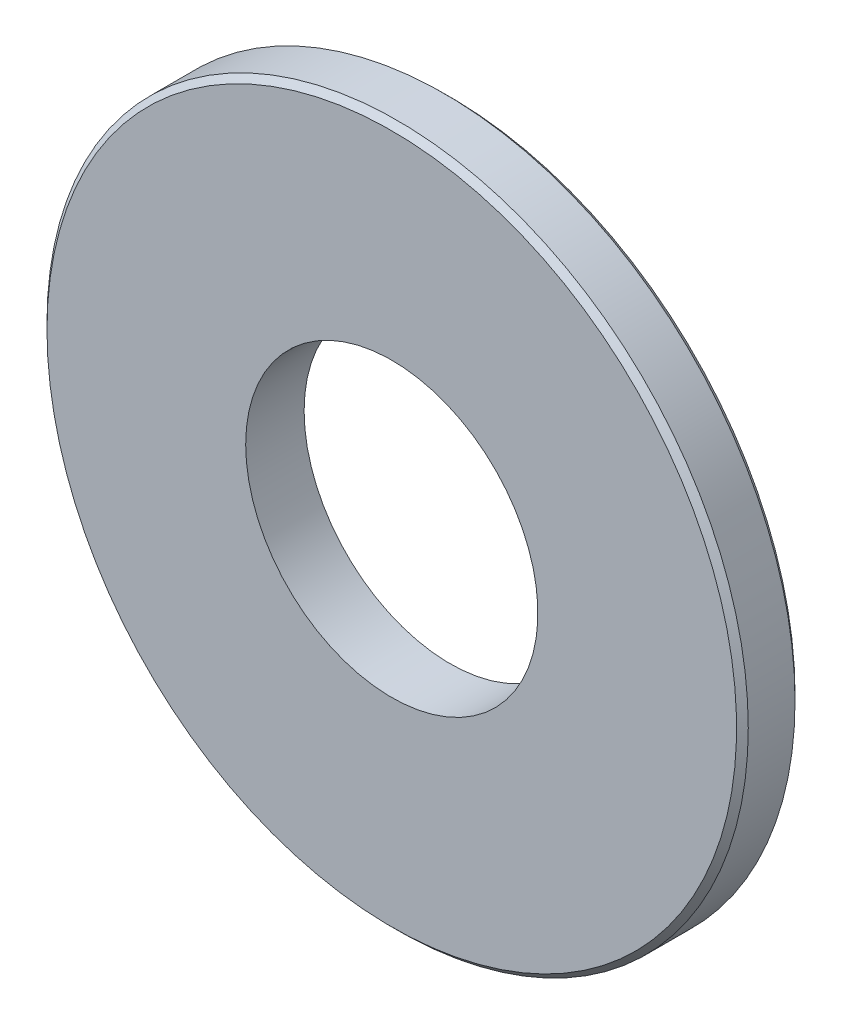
ISO-10303-21;
HEADER;
FILE_DESCRIPTION(('STEP AP214'),'2;1');
FILE_NAME('part.step','',(''),(''),'','','');
FILE_SCHEMA(('AUTOMOTIVE_DESIGN { 1 0 10303 214 1 1 1 1 }'));
ENDSEC;
DATA;
#1=APPLICATION_CONTEXT('core data for automotive mechanical design processes');
#2=APPLICATION_PROTOCOL_DEFINITION('international standard','automotive_design',2000,#1);
#3=PRODUCT_CONTEXT('',#1,'mechanical');
#4=PRODUCT('Part','Part','',(#3));
#5=PRODUCT_RELATED_PRODUCT_CATEGORY('part','',(#4));
#6=PRODUCT_DEFINITION_FORMATION('','',#4);
#7=PRODUCT_DEFINITION_CONTEXT('part definition',#1,'design');
#8=PRODUCT_DEFINITION('design','',#6,#7);
#9=PRODUCT_DEFINITION_SHAPE('','',#8);
#10=(LENGTH_UNIT() NAMED_UNIT(*) SI_UNIT(.MILLI.,.METRE.));
#11=(NAMED_UNIT(*) PLANE_ANGLE_UNIT() SI_UNIT($,.RADIAN.));
#12=(NAMED_UNIT(*) SI_UNIT($,.STERADIAN.) SOLID_ANGLE_UNIT());
#13=UNCERTAINTY_MEASURE_WITH_UNIT(LENGTH_MEASURE(1.E-05),#10,'distance_accuracy_value','');
#14=(GEOMETRIC_REPRESENTATION_CONTEXT(3) GLOBAL_UNCERTAINTY_ASSIGNED_CONTEXT((#13)) GLOBAL_UNIT_ASSIGNED_CONTEXT((#10,
#11,#12)) REPRESENTATION_CONTEXT('',''));
#15=CARTESIAN_POINT('',(0.,0.,0.));
#16=DIRECTION('',(0.,0.,1.));
#17=DIRECTION('',(1.,0.,0.));
#18=AXIS2_PLACEMENT_3D('',#15,#16,#17);
#19=CARTESIAN_POINT('',(0.,0.,1.00000000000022));
#20=DIRECTION('',(0.,0.,1.));
#21=DIRECTION('',(1.00000000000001,0.,0.));
#22=AXIS2_PLACEMENT_3D('',#19,#20,#21);
#23=PLANE('',#22);
#24=CARTESIAN_POINT('',(0.,0.,1.00000000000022));
#25=DIRECTION('',(0.,0.,1.));
#26=DIRECTION('',(1.00000000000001,0.,0.));
#27=AXIS2_PLACEMENT_3D('',#24,#25,#26);
#28=CIRCLE('',#27,5.9);
#29=CARTESIAN_POINT('',(-5.90000000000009,0.,1.00000000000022));
#30=VERTEX_POINT('',#29);
#31=EDGE_CURVE('E53',#30,#30,#28,.T.);
#32=ORIENTED_EDGE('',*,*,#31,.T.);
#33=EDGE_LOOP('',(#32));
#34=FACE_BOUND('',#33,.T.);
#35=CARTESIAN_POINT('',(0.,0.,1.00000000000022));
#36=DIRECTION('',(0.,0.,1.));
#37=DIRECTION('',(1.00000000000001,0.,0.));
#38=AXIS2_PLACEMENT_3D('',#35,#36,#37);
#39=CIRCLE('',#38,2.5);
#40=CARTESIAN_POINT('',(-2.50000000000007,0.,1.00000000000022));
#41=VERTEX_POINT('',#40);
#42=EDGE_CURVE('E58',#41,#41,#39,.T.);
#43=ORIENTED_EDGE('',*,*,#42,.F.);
#44=EDGE_LOOP('',(#43));
#45=FACE_BOUND('',#44,.T.);
#46=ADVANCED_FACE('F38',(#34,#45),#23,.T.);
#47=CARTESIAN_POINT('',(-1.11022302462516E-13,0.,3.33066907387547E-13));
#48=DIRECTION('',(0.,0.,1.));
#49=DIRECTION('',(1.00000000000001,0.,0.));
#50=AXIS2_PLACEMENT_3D('',#47,#48,#49);
#51=PLANE('',#50);
#52=CARTESIAN_POINT('',(-1.11022302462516E-13,0.,3.33066907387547E-13));
#53=DIRECTION('',(0.,0.,1.));
#54=DIRECTION('',(1.00000000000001,0.,0.));
#55=AXIS2_PLACEMENT_3D('',#52,#53,#54);
#56=CIRCLE('',#55,5.9);
#57=CARTESIAN_POINT('',(5.89999999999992,0.,3.3386175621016E-13));
#58=VERTEX_POINT('',#57);
#59=EDGE_CURVE('E10',#58,#58,#56,.F.);
#60=ORIENTED_EDGE('',*,*,#59,.T.);
#61=EDGE_LOOP('',(#60));
#62=FACE_BOUND('',#61,.T.);
#63=CARTESIAN_POINT('',(-1.11022302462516E-13,0.,3.33066907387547E-13));
#64=DIRECTION('',(0.,0.,1.));
#65=DIRECTION('',(1.00000000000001,0.,0.));
#66=AXIS2_PLACEMENT_3D('',#63,#64,#65);
#67=CIRCLE('',#66,2.5);
#68=CARTESIAN_POINT('',(-2.50000000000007,0.,3.33283747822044E-13));
#69=VERTEX_POINT('',#68);
#70=EDGE_CURVE('E61',#69,#69,#67,.T.);
#71=ORIENTED_EDGE('',*,*,#70,.T.);
#72=EDGE_LOOP('',(#71));
#73=FACE_BOUND('',#72,.T.);
#74=ADVANCED_FACE('F65',(#62,#73),#51,.F.);
#75=CARTESIAN_POINT('',(0.,0.,1.00000000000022));
#76=DIRECTION('',(0.,0.,-1.));
#77=DIRECTION('',(-1.00000000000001,0.,0.));
#78=AXIS2_PLACEMENT_3D('',#75,#76,#77);
#79=CYLINDRICAL_SURFACE('',#78,6.);
#80=CARTESIAN_POINT('',(0.,0.,0.900000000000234));
#81=DIRECTION('',(0.,0.,1.));
#82=DIRECTION('',(1.00000000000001,0.,0.));
#83=AXIS2_PLACEMENT_3D('',#80,#81,#82);
#84=CIRCLE('',#83,6.);
#85=CARTESIAN_POINT('',(-6.00000000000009,0.,0.900000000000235));
#86=VERTEX_POINT('',#85);
#87=EDGE_CURVE('E45',#86,#86,#84,.F.);
#88=CARTESIAN_POINT('',(0.,0.,0.100000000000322));
#89=DIRECTION('',(0.,0.,1.));
#90=DIRECTION('',(1.00000000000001,0.,0.));
#91=AXIS2_PLACEMENT_3D('',#88,#89,#90);
#92=CIRCLE('',#91,6.);
#93=CARTESIAN_POINT('',(-6.00000000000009,0.,0.100000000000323));
#94=VERTEX_POINT('',#93);
#95=EDGE_CURVE('E49',#94,#94,#92,.T.);
#96=CARTESIAN_POINT('',(-6.00000000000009,0.,0.900000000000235));
#97=CARTESIAN_POINT('',(-6.00000000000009,0.,0.891666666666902));
#98=CARTESIAN_POINT('',(-6.00000000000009,0.,0.88333333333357));
#99=CARTESIAN_POINT('',(-6.00000000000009,0.,0.866666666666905));
#100=CARTESIAN_POINT('',(-6.00000000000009,0.,0.858333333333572));
#101=CARTESIAN_POINT('',(-6.00000000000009,0.,0.841666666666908));
#102=CARTESIAN_POINT('',(-6.00000000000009,0.,0.833333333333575));
#103=CARTESIAN_POINT('',(-6.00000000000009,0.,0.81666666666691));
#104=CARTESIAN_POINT('',(-6.00000000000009,0.,0.808333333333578));
#105=CARTESIAN_POINT('',(-6.00000000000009,0.,0.791666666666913));
#106=CARTESIAN_POINT('',(-6.00000000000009,0.,0.783333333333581));
#107=CARTESIAN_POINT('',(-6.00000000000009,0.,0.766666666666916));
#108=CARTESIAN_POINT('',(-6.00000000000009,0.,0.758333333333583));
#109=CARTESIAN_POINT('',(-6.00000000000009,0.,0.741666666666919));
#110=CARTESIAN_POINT('',(-6.00000000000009,0.,0.733333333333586));
#111=CARTESIAN_POINT('',(-6.00000000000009,0.,0.716666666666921));
#112=CARTESIAN_POINT('',(-6.00000000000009,0.,0.708333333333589));
#113=CARTESIAN_POINT('',(-6.00000000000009,0.,0.691666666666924));
#114=CARTESIAN_POINT('',(-6.00000000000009,0.,0.683333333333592));
#115=CARTESIAN_POINT('',(-6.00000000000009,0.,0.666666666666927));
#116=CARTESIAN_POINT('',(-6.00000000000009,0.,0.658333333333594));
#117=CARTESIAN_POINT('',(-6.00000000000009,0.,0.64166666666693));
#118=CARTESIAN_POINT('',(-6.00000000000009,0.,0.633333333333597));
#119=CARTESIAN_POINT('',(-6.00000000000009,0.,0.616666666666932));
#120=CARTESIAN_POINT('',(-6.00000000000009,0.,0.6083333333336));
#121=CARTESIAN_POINT('',(-6.00000000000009,0.,0.591666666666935));
#122=CARTESIAN_POINT('',(-6.00000000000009,0.,0.583333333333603));
#123=CARTESIAN_POINT('',(-6.00000000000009,0.,0.566666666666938));
#124=CARTESIAN_POINT('',(-6.00000000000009,0.,0.558333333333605));
#125=CARTESIAN_POINT('',(-6.00000000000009,0.,0.541666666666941));
#126=CARTESIAN_POINT('',(-6.00000000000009,0.,0.533333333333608));
#127=CARTESIAN_POINT('',(-6.00000000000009,0.,0.516666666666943));
#128=CARTESIAN_POINT('',(-6.00000000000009,0.,0.508333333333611));
#129=CARTESIAN_POINT('',(-6.00000000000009,0.,0.491666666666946));
#130=CARTESIAN_POINT('',(-6.00000000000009,0.,0.483333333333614));
#131=CARTESIAN_POINT('',(-6.00000000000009,0.,0.466666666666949));
#132=CARTESIAN_POINT('',(-6.00000000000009,0.,0.458333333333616));
#133=CARTESIAN_POINT('',(-6.00000000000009,0.,0.441666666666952));
#134=CARTESIAN_POINT('',(-6.00000000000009,0.,0.433333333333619));
#135=CARTESIAN_POINT('',(-6.00000000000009,0.,0.416666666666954));
#136=CARTESIAN_POINT('',(-6.00000000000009,0.,0.408333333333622));
#137=CARTESIAN_POINT('',(-6.00000000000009,0.,0.391666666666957));
#138=CARTESIAN_POINT('',(-6.00000000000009,0.,0.383333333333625));
#139=CARTESIAN_POINT('',(-6.00000000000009,0.,0.36666666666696));
#140=CARTESIAN_POINT('',(-6.00000000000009,0.,0.358333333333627));
#141=CARTESIAN_POINT('',(-6.00000000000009,0.,0.341666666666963));
#142=CARTESIAN_POINT('',(-6.00000000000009,0.,0.33333333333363));
#143=CARTESIAN_POINT('',(-6.00000000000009,0.,0.316666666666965));
#144=CARTESIAN_POINT('',(-6.00000000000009,0.,0.308333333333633));
#145=CARTESIAN_POINT('',(-6.00000000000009,0.,0.291666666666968));
#146=CARTESIAN_POINT('',(-6.00000000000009,0.,0.283333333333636));
#147=CARTESIAN_POINT('',(-6.00000000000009,0.,0.266666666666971));
#148=CARTESIAN_POINT('',(-6.00000000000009,0.,0.258333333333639));
#149=CARTESIAN_POINT('',(-6.00000000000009,0.,0.241666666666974));
#150=CARTESIAN_POINT('',(-6.00000000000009,0.,0.233333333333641));
#151=CARTESIAN_POINT('',(-6.00000000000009,0.,0.216666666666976));
#152=CARTESIAN_POINT('',(-6.00000000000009,0.,0.208333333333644));
#153=CARTESIAN_POINT('',(-6.00000000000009,0.,0.191666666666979));
#154=CARTESIAN_POINT('',(-6.00000000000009,0.,0.183333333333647));
#155=CARTESIAN_POINT('',(-6.00000000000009,0.,0.166666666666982));
#156=CARTESIAN_POINT('',(-6.00000000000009,0.,0.15833333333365));
#157=CARTESIAN_POINT('',(-6.00000000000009,0.,0.141666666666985));
#158=CARTESIAN_POINT('',(-6.00000000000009,0.,0.133333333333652));
#159=CARTESIAN_POINT('',(-6.00000000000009,0.,0.116666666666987));
#160=CARTESIAN_POINT('',(-6.00000000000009,0.,0.108333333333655));
#161=CARTESIAN_POINT('',(-6.00000000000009,0.,0.100000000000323));
#162=B_SPLINE_CURVE_WITH_KNOTS('',3,(#96,#97,#98,#99,#100,#101,#102,#103,#104,#105,#106,#107,
#108,#109,#110,#111,#112,#113,#114,#115,#116,#117,#118,#119,#120,#121,#122,#123,#124,#125,#126,
#127,#128,#129,#130,#131,#132,#133,#134,#135,#136,#137,#138,#139,#140,#141,#142,#143,#144,#145,
#146,#147,#148,#149,#150,#151,#152,#153,#154,#155,#156,#157,#158,#159,#160,#161),.UNSPECIFIED.,
.F.,.F.,(4,2,2,2,2,2,2,2,2,2,2,2,2,2,2,2,2,2,2,2,2,2,2,2,2,2,2,2,2,2,2,2,4),(0.,
0.0249999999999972,0.0499999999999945,0.0749999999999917,0.099999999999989,0.124999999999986,
0.149999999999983,0.174999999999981,0.199999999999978,0.224999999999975,0.249999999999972,
0.27499999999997,0.299999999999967,0.324999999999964,0.349999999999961,0.374999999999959,
0.399999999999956,0.424999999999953,0.44999999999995,0.474999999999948,0.499999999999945,
0.524999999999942,0.549999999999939,0.574999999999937,0.599999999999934,0.624999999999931,
0.649999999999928,0.674999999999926,0.699999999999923,0.72499999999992,0.749999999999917,
0.774999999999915,0.799999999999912),.UNSPECIFIED.);
#163=EDGE_CURVE('BSEAM40',#86,#94,#162,.T.);
#164=ORIENTED_EDGE('',*,*,#87,.T.);
#165=ORIENTED_EDGE('',*,*,#95,.T.);
#166=ORIENTED_EDGE('',*,*,#163,.T.);
#167=ORIENTED_EDGE('',*,*,#163,.F.);
#168=EDGE_LOOP('',(#164,#166,#165,#167));
#169=FACE_BOUND('',#168,.T.);
#170=ADVANCED_FACE('F40',(#169),#79,.T.);
#171=CARTESIAN_POINT('',(0.,0.,1.00000000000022));
#172=DIRECTION('',(0.,0.,-1.));
#173=DIRECTION('',(-1.00000000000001,0.,0.));
#174=AXIS2_PLACEMENT_3D('',#171,#172,#173);
#175=CYLINDRICAL_SURFACE('',#174,2.5);
#176=CARTESIAN_POINT('',(-2.50000000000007,0.,1.00000000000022));
#177=CARTESIAN_POINT('',(-2.50000000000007,0.,0.989583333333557));
#178=CARTESIAN_POINT('',(-2.50000000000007,0.,0.979166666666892));
#179=CARTESIAN_POINT('',(-2.50000000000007,0.,0.958333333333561));
#180=CARTESIAN_POINT('',(-2.50000000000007,0.,0.947916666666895));
#181=CARTESIAN_POINT('',(-2.50000000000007,0.,0.927083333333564));
#182=CARTESIAN_POINT('',(-2.50000000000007,0.,0.916666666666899));
#183=CARTESIAN_POINT('',(-2.50000000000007,0.,0.895833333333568));
#184=CARTESIAN_POINT('',(-2.50000000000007,0.,0.885416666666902));
#185=CARTESIAN_POINT('',(-2.50000000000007,0.,0.864583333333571));
#186=CARTESIAN_POINT('',(-2.50000000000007,0.,0.854166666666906));
#187=CARTESIAN_POINT('',(-2.50000000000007,0.,0.833333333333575));
#188=CARTESIAN_POINT('',(-2.50000000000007,0.,0.822916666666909));
#189=CARTESIAN_POINT('',(-2.50000000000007,0.,0.802083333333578));
#190=CARTESIAN_POINT('',(-2.50000000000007,0.,0.791666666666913));
#191=CARTESIAN_POINT('',(-2.50000000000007,0.,0.770833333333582));
#192=CARTESIAN_POINT('',(-2.50000000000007,0.,0.760416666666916));
#193=CARTESIAN_POINT('',(-2.50000000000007,0.,0.739583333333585));
#194=CARTESIAN_POINT('',(-2.50000000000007,0.,0.72916666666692));
#195=CARTESIAN_POINT('',(-2.50000000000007,0.,0.708333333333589));
#196=CARTESIAN_POINT('',(-2.50000000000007,0.,0.697916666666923));
#197=CARTESIAN_POINT('',(-2.50000000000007,0.,0.677083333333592));
#198=CARTESIAN_POINT('',(-2.50000000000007,0.,0.666666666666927));
#199=CARTESIAN_POINT('',(-2.50000000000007,0.,0.645833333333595));
#200=CARTESIAN_POINT('',(-2.50000000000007,0.,0.63541666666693));
#201=CARTESIAN_POINT('',(-2.50000000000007,0.,0.614583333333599));
#202=CARTESIAN_POINT('',(-2.50000000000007,0.,0.604166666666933));
#203=CARTESIAN_POINT('',(-2.50000000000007,0.,0.583333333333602));
#204=CARTESIAN_POINT('',(-2.50000000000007,0.,0.572916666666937));
#205=CARTESIAN_POINT('',(-2.50000000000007,0.,0.552083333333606));
#206=CARTESIAN_POINT('',(-2.50000000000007,0.,0.54166666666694));
#207=CARTESIAN_POINT('',(-2.50000000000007,0.,0.520833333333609));
#208=CARTESIAN_POINT('',(-2.50000000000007,0.,0.510416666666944));
#209=CARTESIAN_POINT('',(-2.50000000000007,0.,0.489583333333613));
#210=CARTESIAN_POINT('',(-2.50000000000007,0.,0.479166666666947));
#211=CARTESIAN_POINT('',(-2.50000000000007,0.,0.458333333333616));
#212=CARTESIAN_POINT('',(-2.50000000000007,0.,0.447916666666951));
#213=CARTESIAN_POINT('',(-2.50000000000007,0.,0.42708333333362));
#214=CARTESIAN_POINT('',(-2.50000000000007,0.,0.416666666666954));
#215=CARTESIAN_POINT('',(-2.50000000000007,0.,0.395833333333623));
#216=CARTESIAN_POINT('',(-2.50000000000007,0.,0.385416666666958));
#217=CARTESIAN_POINT('',(-2.50000000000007,0.,0.364583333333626));
#218=CARTESIAN_POINT('',(-2.50000000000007,0.,0.354166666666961));
#219=CARTESIAN_POINT('',(-2.50000000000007,0.,0.33333333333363));
#220=CARTESIAN_POINT('',(-2.50000000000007,0.,0.322916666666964));
#221=CARTESIAN_POINT('',(-2.50000000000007,0.,0.302083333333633));
#222=CARTESIAN_POINT('',(-2.50000000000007,0.,0.291666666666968));
#223=CARTESIAN_POINT('',(-2.50000000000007,0.,0.270833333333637));
#224=CARTESIAN_POINT('',(-2.50000000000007,0.,0.260416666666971));
#225=CARTESIAN_POINT('',(-2.50000000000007,0.,0.23958333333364));
#226=CARTESIAN_POINT('',(-2.50000000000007,0.,0.229166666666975));
#227=CARTESIAN_POINT('',(-2.50000000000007,0.,0.208333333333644));
#228=CARTESIAN_POINT('',(-2.50000000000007,0.,0.197916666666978));
#229=CARTESIAN_POINT('',(-2.50000000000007,0.,0.177083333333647));
#230=CARTESIAN_POINT('',(-2.50000000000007,0.,0.166666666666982));
#231=CARTESIAN_POINT('',(-2.50000000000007,0.,0.145833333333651));
#232=CARTESIAN_POINT('',(-2.50000000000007,0.,0.135416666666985));
#233=CARTESIAN_POINT('',(-2.50000000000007,0.,0.114583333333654));
#234=CARTESIAN_POINT('',(-2.50000000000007,0.,0.104166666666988));
#235=CARTESIAN_POINT('',(-2.50000000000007,0.,0.0833333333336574));
#236=CARTESIAN_POINT('',(-2.50000000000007,0.,0.0729166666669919));
#237=CARTESIAN_POINT('',(-2.50000000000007,0.,0.0520833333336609));
#238=CARTESIAN_POINT('',(-2.50000000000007,0.,0.0416666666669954));
#239=CARTESIAN_POINT('',(-2.50000000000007,0.,0.0208333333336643));
#240=CARTESIAN_POINT('',(-2.50000000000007,0.,0.0104166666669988));
#241=CARTESIAN_POINT('',(-2.50000000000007,0.,3.33283747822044E-13));
#242=B_SPLINE_CURVE_WITH_KNOTS('',3,(#176,#177,#178,#179,#180,#181,#182,#183,#184,#185,#186,
#187,#188,#189,#190,#191,#192,#193,#194,#195,#196,#197,#198,#199,#200,#201,#202,#203,#204,#205,
#206,#207,#208,#209,#210,#211,#212,#213,#214,#215,#216,#217,#218,#219,#220,#221,#222,#223,#224,
#225,#226,#227,#228,#229,#230,#231,#232,#233,#234,#235,#236,#237,#238,#239,#240,#241),
.UNSPECIFIED.,.F.,.F.,(4,2,2,2,2,2,2,2,2,2,2,2,2,2,2,2,2,2,2,2,2,2,2,2,2,2,2,2,2,2,2,2,4),(0.,
0.0312499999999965,0.062499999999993,0.0937499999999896,0.124999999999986,0.156249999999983,
0.187499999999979,0.218749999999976,0.249999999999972,0.281249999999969,0.312499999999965,
0.343749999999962,0.374999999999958,0.406249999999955,0.437499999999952,0.468749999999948,
0.499999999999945,0.531249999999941,0.562499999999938,0.593749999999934,0.624999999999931,
0.656249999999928,0.687499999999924,0.718749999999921,0.749999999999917,0.781249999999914,
0.81249999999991,0.843749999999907,0.874999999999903,0.9062499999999,0.937499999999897,
0.968749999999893,0.99999999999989),.UNSPECIFIED.);
#243=EDGE_CURVE('BSEAM67',#41,#69,#242,.T.);
#244=ORIENTED_EDGE('',*,*,#42,.T.);
#245=ORIENTED_EDGE('',*,*,#70,.F.);
#246=ORIENTED_EDGE('',*,*,#243,.T.);
#247=ORIENTED_EDGE('',*,*,#243,.F.);
#248=EDGE_LOOP('',(#244,#246,#245,#247));
#249=FACE_BOUND('',#248,.T.);
#250=ADVANCED_FACE('F67',(#249),#175,.F.);
#251=CARTESIAN_POINT('',(0.,0.,1.00000000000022));
#252=DIRECTION('',(0.,0.,-1.));
#253=DIRECTION('',(-1.00000000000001,0.,0.));
#254=AXIS2_PLACEMENT_3D('',#251,#252,#253);
#255=CONICAL_SURFACE('',#254,5.9,0.785398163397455);
#256=CARTESIAN_POINT('',(-6.00000000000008,0.,0.900000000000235));
#257=CARTESIAN_POINT('',(-5.99895833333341,0.,0.901041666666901));
#258=CARTESIAN_POINT('',(-5.99791666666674,0.,0.902083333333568));
#259=CARTESIAN_POINT('',(-5.99583333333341,0.,0.904166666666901));
#260=CARTESIAN_POINT('',(-5.99479166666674,0.,0.905208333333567));
#261=CARTESIAN_POINT('',(-5.99270833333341,0.,0.9072916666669));
#262=CARTESIAN_POINT('',(-5.99166666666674,0.,0.908333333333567));
#263=CARTESIAN_POINT('',(-5.98958333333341,0.,0.9104166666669));
#264=CARTESIAN_POINT('',(-5.98854166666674,0.,0.911458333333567));
#265=CARTESIAN_POINT('',(-5.98645833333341,0.,0.9135416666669));
#266=CARTESIAN_POINT('',(-5.98541666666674,0.,0.914583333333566));
#267=CARTESIAN_POINT('',(-5.98333333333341,0.,0.916666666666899));
#268=CARTESIAN_POINT('',(-5.98229166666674,0.,0.917708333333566));
#269=CARTESIAN_POINT('',(-5.98020833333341,0.,0.919791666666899));
#270=CARTESIAN_POINT('',(-5.97916666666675,0.,0.920833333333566));
#271=CARTESIAN_POINT('',(-5.97708333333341,0.,0.922916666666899));
#272=CARTESIAN_POINT('',(-5.97604166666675,0.,0.923958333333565));
#273=CARTESIAN_POINT('',(-5.97395833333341,0.,0.926041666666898));
#274=CARTESIAN_POINT('',(-5.97291666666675,0.,0.927083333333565));
#275=CARTESIAN_POINT('',(-5.97083333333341,0.,0.929166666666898));
#276=CARTESIAN_POINT('',(-5.96979166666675,0.,0.930208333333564));
#277=CARTESIAN_POINT('',(-5.96770833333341,0.,0.932291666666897));
#278=CARTESIAN_POINT('',(-5.96666666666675,0.,0.933333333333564));
#279=CARTESIAN_POINT('',(-5.96458333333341,0.,0.935416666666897));
#280=CARTESIAN_POINT('',(-5.96354166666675,0.,0.936458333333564));
#281=CARTESIAN_POINT('',(-5.96145833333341,0.,0.938541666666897));
#282=CARTESIAN_POINT('',(-5.96041666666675,0.,0.939583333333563));
#283=CARTESIAN_POINT('',(-5.95833333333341,0.,0.941666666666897));
#284=CARTESIAN_POINT('',(-5.95729166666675,0.,0.942708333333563));
#285=CARTESIAN_POINT('',(-5.95520833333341,0.,0.944791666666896));
#286=CARTESIAN_POINT('',(-5.95416666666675,0.,0.945833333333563));
#287=CARTESIAN_POINT('',(-5.95208333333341,0.,0.947916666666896));
#288=CARTESIAN_POINT('',(-5.95104166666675,0.,0.948958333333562));
#289=CARTESIAN_POINT('',(-5.94895833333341,0.,0.951041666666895));
#290=CARTESIAN_POINT('',(-5.94791666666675,0.,0.952083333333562));
#291=CARTESIAN_POINT('',(-5.94583333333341,0.,0.954166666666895));
#292=CARTESIAN_POINT('',(-5.94479166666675,0.,0.955208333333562));
#293=CARTESIAN_POINT('',(-5.94270833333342,0.,0.957291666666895));
#294=CARTESIAN_POINT('',(-5.94166666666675,0.,0.958333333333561));
#295=CARTESIAN_POINT('',(-5.93958333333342,0.,0.960416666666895));
#296=CARTESIAN_POINT('',(-5.93854166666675,0.,0.961458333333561));
#297=CARTESIAN_POINT('',(-5.93645833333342,0.,0.963541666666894));
#298=CARTESIAN_POINT('',(-5.93541666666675,0.,0.964583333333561));
#299=CARTESIAN_POINT('',(-5.93333333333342,0.,0.966666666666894));
#300=CARTESIAN_POINT('',(-5.93229166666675,0.,0.96770833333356));
#301=CARTESIAN_POINT('',(-5.93020833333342,0.,0.969791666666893));
#302=CARTESIAN_POINT('',(-5.92916666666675,0.,0.97083333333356));
#303=CARTESIAN_POINT('',(-5.92708333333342,0.,0.972916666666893));
#304=CARTESIAN_POINT('',(-5.92604166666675,0.,0.97395833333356));
#305=CARTESIAN_POINT('',(-5.92395833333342,0.,0.976041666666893));
#306=CARTESIAN_POINT('',(-5.92291666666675,0.,0.977083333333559));
#307=CARTESIAN_POINT('',(-5.92083333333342,0.,0.979166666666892));
#308=CARTESIAN_POINT('',(-5.91979166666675,0.,0.980208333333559));
#309=CARTESIAN_POINT('',(-5.91770833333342,0.,0.982291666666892));
#310=CARTESIAN_POINT('',(-5.91666666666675,0.,0.983333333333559));
#311=CARTESIAN_POINT('',(-5.91458333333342,0.,0.985416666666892));
#312=CARTESIAN_POINT('',(-5.91354166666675,0.,0.986458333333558));
#313=CARTESIAN_POINT('',(-5.91145833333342,0.,0.988541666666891));
#314=CARTESIAN_POINT('',(-5.91041666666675,0.,0.989583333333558));
#315=CARTESIAN_POINT('',(-5.90833333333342,0.,0.991666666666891));
#316=CARTESIAN_POINT('',(-5.90729166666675,0.,0.992708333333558));
#317=CARTESIAN_POINT('',(-5.90520833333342,0.,0.994791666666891));
#318=CARTESIAN_POINT('',(-5.90416666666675,0.,0.995833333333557));
#319=CARTESIAN_POINT('',(-5.90208333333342,0.,0.99791666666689));
#320=CARTESIAN_POINT('',(-5.90104166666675,0.,0.998958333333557));
#321=CARTESIAN_POINT('',(-5.90000000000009,0.,1.00000000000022));
#322=B_SPLINE_CURVE_WITH_KNOTS('',3,(#256,#257,#258,#259,#260,#261,#262,#263,#264,#265,#266,
#267,#268,#269,#270,#271,#272,#273,#274,#275,#276,#277,#278,#279,#280,#281,#282,#283,#284,#285,
#286,#287,#288,#289,#290,#291,#292,#293,#294,#295,#296,#297,#298,#299,#300,#301,#302,#303,#304,
#305,#306,#307,#308,#309,#310,#311,#312,#313,#314,#315,#316,#317,#318,#319,#320,#321),
.UNSPECIFIED.,.F.,.F.,(4,2,2,2,2,2,2,2,2,2,2,2,2,2,2,2,2,2,2,2,2,2,2,2,2,2,2,2,2,2,2,2,4),(0.,
0.00441941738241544,0.00883883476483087,0.0132582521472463,0.0176776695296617,
0.0220970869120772,0.0265165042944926,0.030935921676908,0.0353553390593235,0.0397747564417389,
0.044194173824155,0.0486135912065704,0.0530330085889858,0.0574524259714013,0.0618718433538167,
0.0662912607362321,0.0707106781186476,0.075130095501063,0.0795495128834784,0.0839689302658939,
0.0883883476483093,0.0928077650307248,0.0972271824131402,0.101646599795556,0.106066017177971,
0.110485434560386,0.114904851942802,0.119324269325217,0.123743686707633,0.128163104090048,
0.132582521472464,0.13700193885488,0.141421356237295),.UNSPECIFIED.);
#323=EDGE_CURVE('BSEAM69',#86,#30,#322,.T.);
#324=ORIENTED_EDGE('',*,*,#87,.F.);
#325=ORIENTED_EDGE('',*,*,#31,.F.);
#326=ORIENTED_EDGE('',*,*,#323,.T.);
#327=ORIENTED_EDGE('',*,*,#323,.F.);
#328=EDGE_LOOP('',(#324,#326,#325,#327));
#329=FACE_BOUND('',#328,.T.);
#330=ADVANCED_FACE('F69',(#329),#255,.T.);
#331=CARTESIAN_POINT('',(0.,0.,0.100000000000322));
#332=DIRECTION('',(0.,0.,1.));
#333=DIRECTION('',(1.00000000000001,0.,0.));
#334=AXIS2_PLACEMENT_3D('',#331,#332,#333);
#335=CONICAL_SURFACE('',#334,6.,0.785398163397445);
#336=ORIENTED_EDGE('',*,*,#59,.F.);
#337=EDGE_LOOP('',(#336));
#338=FACE_BOUND('',#337,.T.);
#339=ORIENTED_EDGE('',*,*,#95,.F.);
#340=EDGE_LOOP('',(#339));
#341=FACE_BOUND('',#340,.T.);
#342=ADVANCED_FACE('F76',(#338,#341),#335,.T.);
#343=CLOSED_SHELL('',(#46,#74,#170,#250,#330,#342));
#344=MANIFOLD_SOLID_BREP('B2',#343);
#345=ADVANCED_BREP_SHAPE_REPRESENTATION('',(#18,#344),#14);
#346=SHAPE_DEFINITION_REPRESENTATION(#9,#345);
ENDSEC;
END-ISO-10303-21;
